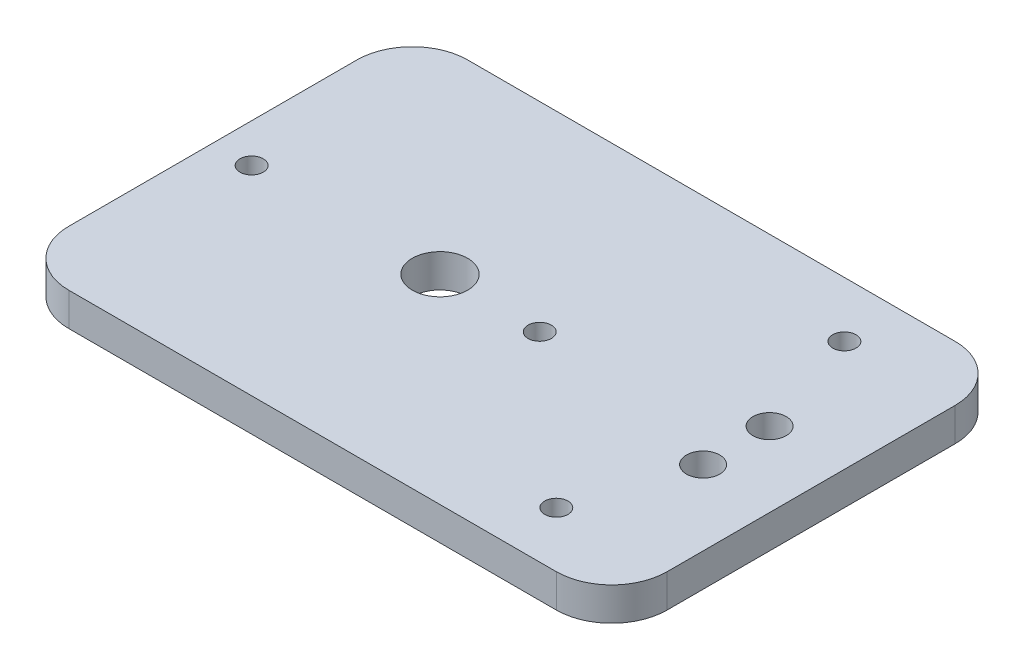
from build123d import *

# Parameters (mm, degrees)
SKETCH1_R         = 5
SKETCH1_R_2       = 3
EXTRUDE1_DEPTH    = 6
M5_TAPPED_HOLE1_D = 4.2


with BuildPart() as part:
    # Sketch1 → Extrude1 (new body)
    with BuildSketch(Plane(origin=(0, 0, 0), x_dir=(1, 0, 0), z_dir=(0, 1, 0))):
        with BuildLine():
            Line((10, 0), (98, 0))
            ThreePointArc((98, 0), (105.071067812, 2.928932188), (108, 10))
            Line((108, 10), (108, 62))
            ThreePointArc((108, 62), (105.071067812, 69.071067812), (98, 72))
            Line((98, 72), (10, 72))
            ThreePointArc((10, 72), (2.928932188, 69.071067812), (0, 62))
            Line((0, 62), (0, 10))
            ThreePointArc((0, 10), (2.928932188, 2.928932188), (10, 0))
        make_face()
        with Locations(Location((41, 36, 0), (0, 0, 270))):
            Circle(SKETCH1_R, mode=Mode.SUBTRACT)
        with Locations(Location((94.496478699, 42, 0), (0, 0, 270))):
            Circle(SKETCH1_R_2, mode=Mode.SUBTRACT)
        with Locations(Location((94.496478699, 30, 0), (0, 0, 270))):
            Circle(SKETCH1_R_2, mode=Mode.SUBTRACT)
    extrude(amount=EXTRUDE1_DEPTH)

    # M5 Tapped Hole1 (through all)
    with Locations(Plane(origin=(7, 6, -36), x_dir=(0, 0, 1), z_dir=(0, 1, 0))):
        with Locations((0, 0), (0, 52), (-26, 81), (26, 81)):
            Hole(M5_TAPPED_HOLE1_D / 2)


solid = part.part
